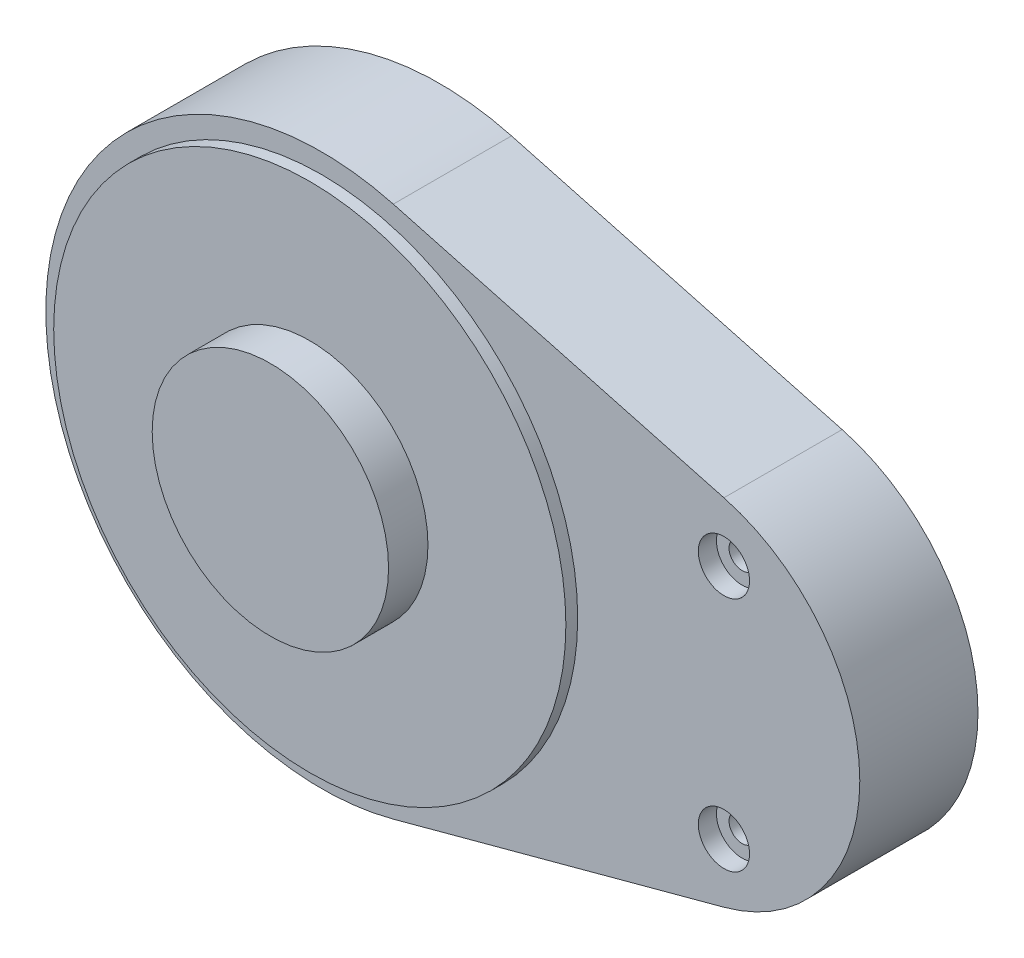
from build123d import *

# Parameters (mm, degrees)
BOSS_EXTRUDE1_DEPTH                      = 30
SKETCH2_W                                = 30
SKETCH2_H                                = 30
BOSS_EXTRUDE2_DEPTH                      = 10
SKETCH3_R                                = 65
BOSS_EXTRUDE3_DEPTH                      = 3
SKETCH4_R                                = 30
BOSS_EXTRUDE4_DEPTH                      = 10
CBORE_FOR_M6_PAN_HEAD_SCREW1_D           = 6.6
CBORE_FOR_M6_PAN_HEAD_SCREW1_DEPTH       = 50.5
CBORE_FOR_M6_PAN_HEAD_SCREW1_CBORE_D     = 13
CBORE_FOR_M6_PAN_HEAD_SCREW1_CBORE_DEPTH = 4.6
CBORE_FOR_M6_PAN_HEAD_SCREW1_TIP         = 1.982840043


with BuildPart() as part:
    # Sketch1 → Boss-Extrude1 (new body)
    with BuildSketch(Plane.XY):
        with BuildLine():
            Line((12.115384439, 172.009473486), (-71.801857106, 194.602576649))
            ThreePointArc((-71.801857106, 194.602576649), (-160, 127.009473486), (-71.801857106, 59.416370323))
            Line((-71.801857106, 59.416370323), (12.115384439, 82.009473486))
            ThreePointArc((12.115384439, 82.009473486), (46.602387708, 127.009473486), (12.115384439, 172.009473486))
        make_face()
    extrude(amount=BOSS_EXTRUDE1_DEPTH)

    # Sketch2 → Boss-Extrude2 (add)
    with BuildSketch(Plane(origin=(0, 0, 0), x_dir=(-1, 0, 0), z_dir=(0, 0, -1))):
        with Locations((90, 127.009473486)):
            Rectangle(SKETCH2_W, SKETCH2_H)
    extrude(amount=BOSS_EXTRUDE2_DEPTH)

    # Sketch3 → Boss-Extrude3 (add)
    with BuildSketch(Plane.XY.offset(30)):
        with Locations((-90, 127.009473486)):
            Circle(SKETCH3_R)
    extrude(amount=BOSS_EXTRUDE3_DEPTH)

    # Sketch4 → Boss-Extrude4 (add)
    with BuildSketch(Plane.XY.offset(33)):
        with Locations((-90, 127.009473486)):
            Circle(SKETCH4_R)
    extrude(amount=BOSS_EXTRUDE4_DEPTH)

    # CBORE for M6 Pan Head Screw1
    with Locations(Plane(origin=(12.115384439, 157.009473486, 30), x_dir=(1, 0, 0), z_dir=(0, 0, 1))):
        with Locations((0, 0), (0, -60)):
            CounterBoreHole(CBORE_FOR_M6_PAN_HEAD_SCREW1_D / 2, CBORE_FOR_M6_PAN_HEAD_SCREW1_CBORE_D / 2, CBORE_FOR_M6_PAN_HEAD_SCREW1_CBORE_DEPTH, depth=CBORE_FOR_M6_PAN_HEAD_SCREW1_DEPTH)
            with Locations((0, 0, -(CBORE_FOR_M6_PAN_HEAD_SCREW1_DEPTH + CBORE_FOR_M6_PAN_HEAD_SCREW1_TIP / 2))):  # 118° drill point
                Cone(0, CBORE_FOR_M6_PAN_HEAD_SCREW1_D / 2, CBORE_FOR_M6_PAN_HEAD_SCREW1_TIP, mode=Mode.SUBTRACT)


solid = part.part
